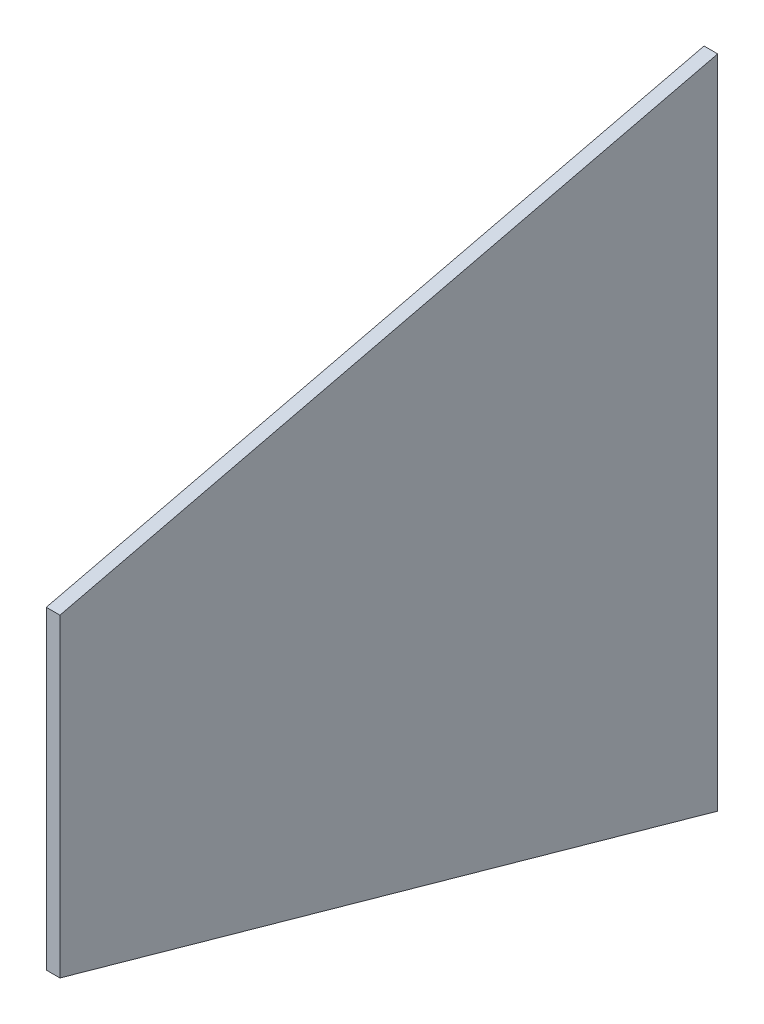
from build123d import *

# Parameters (mm, degrees)
MEASURED_ASYMMETRIC_PANEL_DEPTH = 6.35


with BuildPart() as part:
    # Sketch1 → Measured_asymmetric_panel (new body)
    with BuildSketch(Plane.YZ):
        Polygon((0, 0), (304.8, 0), (231.74325, 305.71705367), (85.69325, 305.71705367), align=None)
    extrude(amount=MEASURED_ASYMMETRIC_PANEL_DEPTH)


solid = part.part
